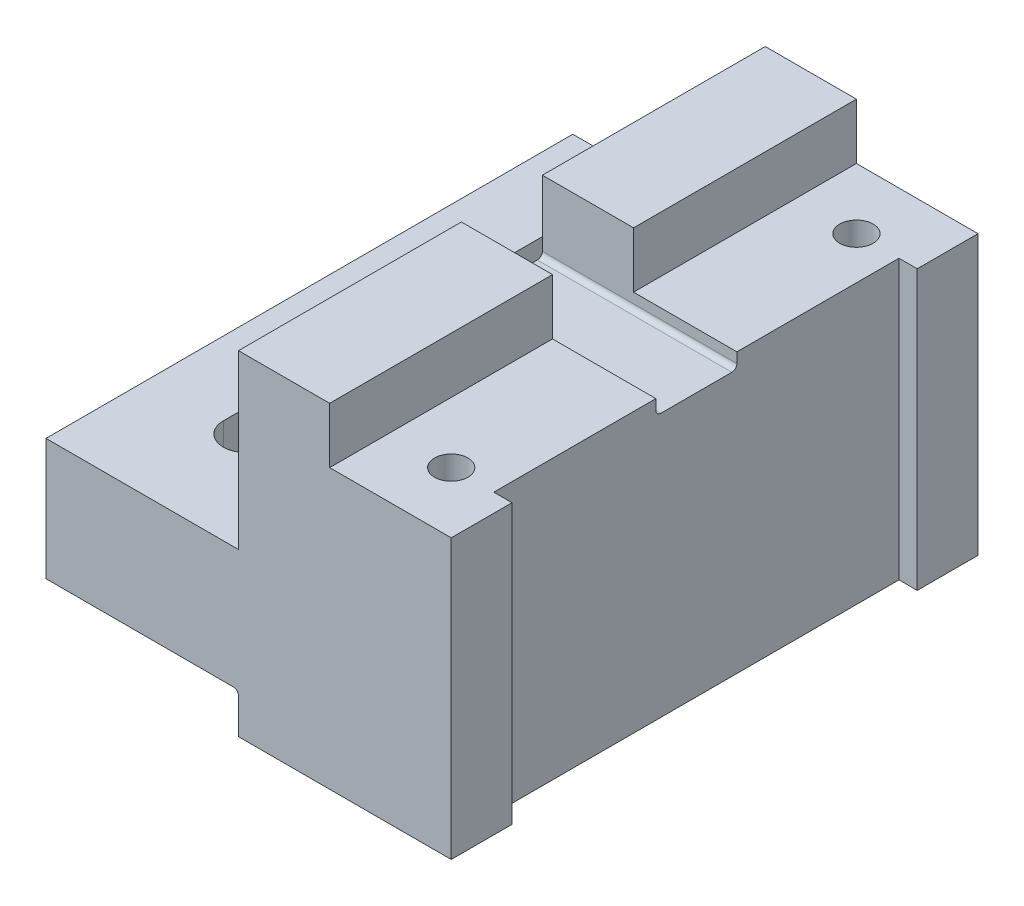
ISO-10303-21;
HEADER;
FILE_DESCRIPTION(('STEP AP214'),'2;1');
FILE_NAME('part.step','',(''),(''),'','','');
FILE_SCHEMA(('AUTOMOTIVE_DESIGN { 1 0 10303 214 1 1 1 1 }'));
ENDSEC;
DATA;
#1=APPLICATION_CONTEXT('core data for automotive mechanical design processes');
#2=APPLICATION_PROTOCOL_DEFINITION('international standard','automotive_design',2000,#1);
#3=PRODUCT_CONTEXT('',#1,'mechanical');
#4=PRODUCT('Part','Part','',(#3));
#5=PRODUCT_RELATED_PRODUCT_CATEGORY('part','',(#4));
#6=PRODUCT_DEFINITION_FORMATION('','',#4);
#7=PRODUCT_DEFINITION_CONTEXT('part definition',#1,'design');
#8=PRODUCT_DEFINITION('design','',#6,#7);
#9=PRODUCT_DEFINITION_SHAPE('','',#8);
#10=(LENGTH_UNIT() NAMED_UNIT(*) SI_UNIT(.MILLI.,.METRE.));
#11=(NAMED_UNIT(*) PLANE_ANGLE_UNIT() SI_UNIT($,.RADIAN.));
#12=(NAMED_UNIT(*) SI_UNIT($,.STERADIAN.) SOLID_ANGLE_UNIT());
#13=UNCERTAINTY_MEASURE_WITH_UNIT(LENGTH_MEASURE(1.E-05),#10,'distance_accuracy_value','');
#14=(GEOMETRIC_REPRESENTATION_CONTEXT(3) GLOBAL_UNCERTAINTY_ASSIGNED_CONTEXT((#13)) GLOBAL_UNIT_ASSIGNED_CONTEXT((#10,
#11,#12)) REPRESENTATION_CONTEXT('',''));
#15=CARTESIAN_POINT('',(0.,0.,0.));
#16=DIRECTION('',(0.,0.,1.));
#17=DIRECTION('',(1.,0.,0.));
#18=AXIS2_PLACEMENT_3D('',#15,#16,#17);
#19=CARTESIAN_POINT('',(148.,206.010687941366,52.));
#20=DIRECTION('',(0.,1.,0.));
#21=DIRECTION('',(0.,0.,1.));
#22=AXIS2_PLACEMENT_3D('',#19,#20,#21);
#23=PLANE('',#22);
#24=DIRECTION('',(1.,0.,0.));
#25=VECTOR('',#24,1.);
#26=CARTESIAN_POINT('',(148.,206.010687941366,0.));
#27=LINE('',#26,#25);
#28=CARTESIAN_POINT('',(148.,206.010687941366,0.));
#29=VERTEX_POINT('',#28);
#30=CARTESIAN_POINT('',(166.5,206.010687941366,0.));
#31=VERTEX_POINT('',#30);
#32=EDGE_CURVE('E482',#29,#31,#27,.T.);
#33=ORIENTED_EDGE('',*,*,#32,.T.);
#34=DIRECTION('',(0.,0.,-1.));
#35=VECTOR('',#34,1.);
#36=CARTESIAN_POINT('',(166.5,206.010687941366,52.));
#37=LINE('',#36,#35);
#38=CARTESIAN_POINT('',(166.5,206.010687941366,52.));
#39=VERTEX_POINT('',#38);
#40=EDGE_CURVE('E31',#31,#39,#37,.F.);
#41=ORIENTED_EDGE('',*,*,#40,.T.);
#42=DIRECTION('',(1.,0.,0.));
#43=VECTOR('',#42,1.);
#44=CARTESIAN_POINT('',(148.,206.010687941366,52.));
#45=LINE('',#44,#43);
#46=CARTESIAN_POINT('',(148.,206.010687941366,52.));
#47=VERTEX_POINT('',#46);
#48=EDGE_CURVE('E463',#47,#39,#45,.T.);
#49=ORIENTED_EDGE('',*,*,#48,.F.);
#50=DIRECTION('',(0.,0.,-1.));
#51=VECTOR('',#50,1.);
#52=CARTESIAN_POINT('',(148.,206.010687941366,52.));
#53=LINE('',#52,#51);
#54=EDGE_CURVE('E514',#47,#29,#53,.T.);
#55=ORIENTED_EDGE('',*,*,#54,.T.);
#56=EDGE_LOOP('',(#33,#41,#49,#55));
#57=FACE_BOUND('',#56,.T.);
#58=DIRECTION('',(0.,0.,1.));
#59=VECTOR('',#58,1.);
#60=CARTESIAN_POINT('',(153.5,206.010687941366,38.25));
#61=LINE('',#60,#59);
#62=CARTESIAN_POINT('',(153.5,206.010687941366,38.25));
#63=VERTEX_POINT('',#62);
#64=CARTESIAN_POINT('',(153.5,206.010687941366,41.75));
#65=VERTEX_POINT('',#64);
#66=EDGE_CURVE('E338',#63,#65,#61,.T.);
#67=ORIENTED_EDGE('',*,*,#66,.T.);
#68=CARTESIAN_POINT('',(157.5,206.010687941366,41.75));
#69=DIRECTION('',(0.,-1.,0.));
#70=DIRECTION('',(0.,0.,-1.));
#71=AXIS2_PLACEMENT_3D('',#68,#69,#70);
#72=CIRCLE('',#71,4.);
#73=CARTESIAN_POINT('',(161.5,206.010687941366,41.75));
#74=VERTEX_POINT('',#73);
#75=EDGE_CURVE('E366',#74,#65,#72,.T.);
#76=ORIENTED_EDGE('',*,*,#75,.F.);
#77=DIRECTION('',(0.,0.,1.));
#78=VECTOR('',#77,1.);
#79=CARTESIAN_POINT('',(161.5,206.010687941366,38.25));
#80=LINE('',#79,#78);
#81=CARTESIAN_POINT('',(161.5,206.010687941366,38.25));
#82=VERTEX_POINT('',#81);
#83=EDGE_CURVE('E327',#82,#74,#80,.T.);
#84=ORIENTED_EDGE('',*,*,#83,.F.);
#85=CARTESIAN_POINT('',(157.5,206.010687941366,38.25));
#86=DIRECTION('',(0.,-1.,0.));
#87=DIRECTION('',(0.,0.,-1.));
#88=AXIS2_PLACEMENT_3D('',#85,#86,#87);
#89=CIRCLE('',#88,4.);
#90=EDGE_CURVE('E350',#63,#82,#89,.T.);
#91=ORIENTED_EDGE('',*,*,#90,.F.);
#92=EDGE_LOOP('',(#67,#76,#84,#91));
#93=FACE_BOUND('',#92,.T.);
#94=CARTESIAN_POINT('',(157.5,206.010687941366,13.75));
#95=DIRECTION('',(0.,-1.,0.));
#96=DIRECTION('',(0.,0.,-1.));
#97=AXIS2_PLACEMENT_3D('',#94,#95,#96);
#98=CIRCLE('',#97,4.);
#99=CARTESIAN_POINT('',(161.5,206.010687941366,13.75));
#100=VERTEX_POINT('',#99);
#101=CARTESIAN_POINT('',(153.5,206.010687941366,13.75));
#102=VERTEX_POINT('',#101);
#103=EDGE_CURVE('E317',#100,#102,#98,.T.);
#104=ORIENTED_EDGE('',*,*,#103,.F.);
#105=DIRECTION('',(0.,0.,1.));
#106=VECTOR('',#105,1.);
#107=CARTESIAN_POINT('',(161.5,206.010687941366,10.25));
#108=LINE('',#107,#106);
#109=CARTESIAN_POINT('',(161.5,206.010687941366,10.25));
#110=VERTEX_POINT('',#109);
#111=EDGE_CURVE('E293',#110,#100,#108,.T.);
#112=ORIENTED_EDGE('',*,*,#111,.F.);
#113=CARTESIAN_POINT('',(157.5,206.010687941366,10.25));
#114=DIRECTION('',(0.,-1.,0.));
#115=DIRECTION('',(0.,0.,-1.));
#116=AXIS2_PLACEMENT_3D('',#113,#114,#115);
#117=CIRCLE('',#116,4.);
#118=CARTESIAN_POINT('',(153.5,206.010687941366,10.25));
#119=VERTEX_POINT('',#118);
#120=EDGE_CURVE('E283',#119,#110,#117,.T.);
#121=ORIENTED_EDGE('',*,*,#120,.F.);
#122=DIRECTION('',(0.,0.,1.));
#123=VECTOR('',#122,1.);
#124=CARTESIAN_POINT('',(153.5,206.010687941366,10.25));
#125=LINE('',#124,#123);
#126=EDGE_CURVE('E303',#119,#102,#125,.T.);
#127=ORIENTED_EDGE('',*,*,#126,.T.);
#128=EDGE_LOOP('',(#104,#112,#121,#127));
#129=FACE_BOUND('',#128,.T.);
#130=ADVANCED_FACE('F16',(#57,#93,#129),#23,.F.);
#131=CARTESIAN_POINT('',(167.,235.010687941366,52.));
#132=DIRECTION('',(0.,-1.,0.));
#133=DIRECTION('',(0.,0.,-1.));
#134=AXIS2_PLACEMENT_3D('',#131,#132,#133);
#135=PLANE('',#134);
#136=DIRECTION('',(0.,0.,-1.));
#137=VECTOR('',#136,1.);
#138=CARTESIAN_POINT('',(167.,235.010687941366,52.));
#139=LINE('',#138,#137);
#140=CARTESIAN_POINT('',(167.,235.010687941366,22.));
#141=VERTEX_POINT('',#140);
#142=CARTESIAN_POINT('',(167.,235.010687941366,0.));
#143=VERTEX_POINT('',#142);
#144=EDGE_CURVE('E503',#141,#143,#139,.T.);
#145=ORIENTED_EDGE('',*,*,#144,.F.);
#146=DIRECTION('',(-1.,0.,0.));
#147=VECTOR('',#146,1.);
#148=CARTESIAN_POINT('',(167.,235.010687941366,22.));
#149=LINE('',#148,#147);
#150=CARTESIAN_POINT('',(176.,235.010687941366,22.));
#151=VERTEX_POINT('',#150);
#152=EDGE_CURVE('E382',#151,#141,#149,.T.);
#153=ORIENTED_EDGE('',*,*,#152,.F.);
#154=DIRECTION('',(0.,0.,1.));
#155=VECTOR('',#154,1.);
#156=CARTESIAN_POINT('',(176.,235.010687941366,0.));
#157=LINE('',#156,#155);
#158=CARTESIAN_POINT('',(176.,235.010687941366,0.));
#159=VERTEX_POINT('',#158);
#160=EDGE_CURVE('E433',#159,#151,#157,.T.);
#161=ORIENTED_EDGE('',*,*,#160,.F.);
#162=DIRECTION('',(-1.,0.,0.));
#163=VECTOR('',#162,1.);
#164=CARTESIAN_POINT('',(167.,235.010687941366,0.));
#165=LINE('',#164,#163);
#166=EDGE_CURVE('E492',#159,#143,#165,.T.);
#167=ORIENTED_EDGE('',*,*,#166,.T.);
#168=EDGE_LOOP('',(#145,#153,#161,#167));
#169=FACE_BOUND('',#168,.T.);
#170=ADVANCED_FACE('F606',(#169),#135,.F.);
#171=CARTESIAN_POINT('',(188.,229.510687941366,0.));
#172=DIRECTION('',(0.,-1.,0.));
#173=DIRECTION('',(0.,0.,-1.));
#174=AXIS2_PLACEMENT_3D('',#171,#172,#173);
#175=PLANE('',#174);
#176=CARTESIAN_POINT('',(182.,229.510687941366,6.));
#177=DIRECTION('',(0.,1.,0.));
#178=DIRECTION('',(0.,0.,1.));
#179=AXIS2_PLACEMENT_3D('',#176,#177,#178);
#180=CIRCLE('',#179,1.65);
#181=CARTESIAN_POINT('',(182.,229.510687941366,7.65));
#182=VERTEX_POINT('',#181);
#183=EDGE_CURVE('E406',#182,#182,#180,.T.);
#184=ORIENTED_EDGE('',*,*,#183,.F.);
#185=EDGE_LOOP('',(#184));
#186=FACE_BOUND('',#185,.T.);
#187=DIRECTION('',(0.,0.,1.));
#188=VECTOR('',#187,1.);
#189=CARTESIAN_POINT('',(176.,229.510687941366,0.));
#190=LINE('',#189,#188);
#191=CARTESIAN_POINT('',(176.,229.510687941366,0.));
#192=VERTEX_POINT('',#191);
#193=CARTESIAN_POINT('',(176.,229.510687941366,22.));
#194=VERTEX_POINT('',#193);
#195=EDGE_CURVE('E429',#192,#194,#190,.T.);
#196=ORIENTED_EDGE('',*,*,#195,.T.);
#197=DIRECTION('',(1.,0.,0.));
#198=VECTOR('',#197,1.);
#199=CARTESIAN_POINT('',(188.,229.510687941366,22.));
#200=LINE('',#199,#198);
#201=CARTESIAN_POINT('',(186.199999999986,229.510687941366,22.));
#202=VERTEX_POINT('',#201);
#203=EDGE_CURVE('E394',#194,#202,#200,.T.);
#204=ORIENTED_EDGE('',*,*,#203,.T.);
#205=DIRECTION('',(0.,0.,1.));
#206=VECTOR('',#205,1.);
#207=CARTESIAN_POINT('',(186.199999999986,229.510687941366,5.99999999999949));
#208=LINE('',#207,#206);
#209=CARTESIAN_POINT('',(186.199999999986,229.510687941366,5.99999999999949));
#210=VERTEX_POINT('',#209);
#211=EDGE_CURVE('E518',#210,#202,#208,.T.);
#212=ORIENTED_EDGE('',*,*,#211,.F.);
#213=DIRECTION('',(-1.,0.,0.));
#214=VECTOR('',#213,1.);
#215=CARTESIAN_POINT('',(186.199999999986,229.510687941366,5.99999999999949));
#216=LINE('',#215,#214);
#217=CARTESIAN_POINT('',(188.,229.510687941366,5.99999999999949));
#218=VERTEX_POINT('',#217);
#219=EDGE_CURVE('E427',#218,#210,#216,.T.);
#220=ORIENTED_EDGE('',*,*,#219,.F.);
#221=DIRECTION('',(0.,0.,1.));
#222=VECTOR('',#221,1.);
#223=CARTESIAN_POINT('',(188.,229.510687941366,0.));
#224=LINE('',#223,#222);
#225=CARTESIAN_POINT('',(188.,229.510687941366,0.));
#226=VERTEX_POINT('',#225);
#227=EDGE_CURVE('E424',#226,#218,#224,.T.);
#228=ORIENTED_EDGE('',*,*,#227,.F.);
#229=DIRECTION('',(1.,0.,0.));
#230=VECTOR('',#229,1.);
#231=CARTESIAN_POINT('',(188.,229.510687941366,0.));
#232=LINE('',#231,#230);
#233=EDGE_CURVE('E416',#192,#226,#232,.T.);
#234=ORIENTED_EDGE('',*,*,#233,.F.);
#235=EDGE_LOOP('',(#196,#204,#212,#220,#228,#234));
#236=FACE_BOUND('',#235,.T.);
#237=ADVANCED_FACE('F612',(#186,#236),#175,.F.);
#238=CARTESIAN_POINT('',(176.,235.010687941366,0.));
#239=DIRECTION('',(-1.,0.,0.));
#240=DIRECTION('',(0.,0.,1.));
#241=AXIS2_PLACEMENT_3D('',#238,#239,#240);
#242=PLANE('',#241);
#243=ORIENTED_EDGE('',*,*,#160,.T.);
#244=DIRECTION('',(0.,-1.,0.));
#245=VECTOR('',#244,1.);
#246=CARTESIAN_POINT('',(176.,235.010687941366,22.));
#247=LINE('',#246,#245);
#248=EDGE_CURVE('E524',#151,#194,#247,.T.);
#249=ORIENTED_EDGE('',*,*,#248,.T.);
#250=ORIENTED_EDGE('',*,*,#195,.F.);
#251=DIRECTION('',(0.,-1.,0.));
#252=VECTOR('',#251,1.);
#253=CARTESIAN_POINT('',(176.,235.010687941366,0.));
#254=LINE('',#253,#252);
#255=EDGE_CURVE('E413',#159,#192,#254,.T.);
#256=ORIENTED_EDGE('',*,*,#255,.F.);
#257=EDGE_LOOP('',(#243,#249,#250,#256));
#258=FACE_BOUND('',#257,.T.);
#259=ADVANCED_FACE('F694',(#258),#242,.F.);
#260=CARTESIAN_POINT('',(188.,202.010687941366,52.));
#261=DIRECTION('',(-1.,0.,0.));
#262=DIRECTION('',(0.,0.,1.));
#263=AXIS2_PLACEMENT_3D('',#260,#261,#262);
#264=PLANE('',#263);
#265=DIRECTION('',(0.,1.,0.));
#266=VECTOR('',#265,1.);
#267=CARTESIAN_POINT('',(188.,202.010687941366,46.));
#268=LINE('',#267,#266);
#269=CARTESIAN_POINT('',(188.,202.010687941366,46.));
#270=VERTEX_POINT('',#269);
#271=CARTESIAN_POINT('',(188.,229.510687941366,46.));
#272=VERTEX_POINT('',#271);
#273=EDGE_CURVE('E456',#270,#272,#268,.T.);
#274=ORIENTED_EDGE('',*,*,#273,.T.);
#275=CARTESIAN_POINT('',(188.,229.510687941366,52.));
#276=VERTEX_POINT('',#275);
#277=EDGE_CURVE('E428',#272,#276,#224,.T.);
#278=ORIENTED_EDGE('',*,*,#277,.T.);
#279=DIRECTION('',(0.,1.,0.));
#280=VECTOR('',#279,1.);
#281=CARTESIAN_POINT('',(188.,202.010687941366,52.));
#282=LINE('',#281,#280);
#283=CARTESIAN_POINT('',(188.,202.010687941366,52.));
#284=VERTEX_POINT('',#283);
#285=EDGE_CURVE('E470',#284,#276,#282,.T.);
#286=ORIENTED_EDGE('',*,*,#285,.F.);
#287=DIRECTION('',(0.,0.,-1.));
#288=VECTOR('',#287,1.);
#289=CARTESIAN_POINT('',(188.,202.010687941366,52.));
#290=LINE('',#289,#288);
#291=EDGE_CURVE('E508',#284,#270,#290,.T.);
#292=ORIENTED_EDGE('',*,*,#291,.T.);
#293=EDGE_LOOP('',(#274,#278,#286,#292));
#294=FACE_BOUND('',#293,.T.);
#295=ADVANCED_FACE('F623',(#294),#264,.F.);
#296=CARTESIAN_POINT('',(148.,206.010687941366,52.));
#297=DIRECTION('',(1.,0.,0.));
#298=DIRECTION('',(0.,0.,-1.));
#299=AXIS2_PLACEMENT_3D('',#296,#297,#298);
#300=PLANE('',#299);
#301=DIRECTION('',(0.,-1.,0.));
#302=VECTOR('',#301,1.);
#303=CARTESIAN_POINT('',(148.,206.010687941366,0.));
#304=LINE('',#303,#302);
#305=CARTESIAN_POINT('',(148.,218.010687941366,0.));
#306=VERTEX_POINT('',#305);
#307=EDGE_CURVE('E459',#306,#29,#304,.T.);
#308=ORIENTED_EDGE('',*,*,#307,.T.);
#309=ORIENTED_EDGE('',*,*,#54,.F.);
#310=DIRECTION('',(0.,-1.,0.));
#311=VECTOR('',#310,1.);
#312=CARTESIAN_POINT('',(148.,206.010687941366,52.));
#313=LINE('',#312,#311);
#314=CARTESIAN_POINT('',(148.,218.010687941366,52.));
#315=VERTEX_POINT('',#314);
#316=EDGE_CURVE('E460',#315,#47,#313,.T.);
#317=ORIENTED_EDGE('',*,*,#316,.F.);
#318=DIRECTION('',(0.,0.,-1.));
#319=VECTOR('',#318,1.);
#320=CARTESIAN_POINT('',(148.,218.010687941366,52.));
#321=LINE('',#320,#319);
#322=EDGE_CURVE('E479',#315,#306,#321,.T.);
#323=ORIENTED_EDGE('',*,*,#322,.T.);
#324=EDGE_LOOP('',(#308,#309,#317,#323));
#325=FACE_BOUND('',#324,.T.);
#326=ADVANCED_FACE('F620',(#325),#300,.F.);
#327=CARTESIAN_POINT('',(167.,206.010687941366,52.));
#328=DIRECTION('',(1.,0.,0.));
#329=DIRECTION('',(0.,0.,-1.));
#330=AXIS2_PLACEMENT_3D('',#327,#328,#329);
#331=PLANE('',#330);
#332=DIRECTION('',(0.,-1.,0.));
#333=VECTOR('',#332,1.);
#334=CARTESIAN_POINT('',(167.,206.010687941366,52.));
#335=LINE('',#334,#333);
#336=CARTESIAN_POINT('',(167.,205.510687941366,52.));
#337=VERTEX_POINT('',#336);
#338=CARTESIAN_POINT('',(167.,202.010687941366,52.));
#339=VERTEX_POINT('',#338);
#340=EDGE_CURVE('E466',#337,#339,#335,.T.);
#341=ORIENTED_EDGE('',*,*,#340,.F.);
#342=DIRECTION('',(0.,0.,-1.));
#343=VECTOR('',#342,1.);
#344=CARTESIAN_POINT('',(167.,205.510687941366,0.));
#345=LINE('',#344,#343);
#346=CARTESIAN_POINT('',(167.,205.510687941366,0.));
#347=VERTEX_POINT('',#346);
#348=EDGE_CURVE('E572',#337,#347,#345,.T.);
#349=ORIENTED_EDGE('',*,*,#348,.T.);
#350=DIRECTION('',(0.,-1.,0.));
#351=VECTOR('',#350,1.);
#352=CARTESIAN_POINT('',(167.,206.010687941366,0.));
#353=LINE('',#352,#351);
#354=CARTESIAN_POINT('',(167.,202.010687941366,0.));
#355=VERTEX_POINT('',#354);
#356=EDGE_CURVE('E484',#347,#355,#353,.T.);
#357=ORIENTED_EDGE('',*,*,#356,.T.);
#358=DIRECTION('',(0.,0.,-1.));
#359=VECTOR('',#358,1.);
#360=CARTESIAN_POINT('',(167.,202.010687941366,52.));
#361=LINE('',#360,#359);
#362=EDGE_CURVE('E511',#339,#355,#361,.T.);
#363=ORIENTED_EDGE('',*,*,#362,.F.);
#364=EDGE_LOOP('',(#341,#349,#357,#363));
#365=FACE_BOUND('',#364,.T.);
#366=ADVANCED_FACE('F578',(#365),#331,.F.);
#367=CARTESIAN_POINT('',(188.,202.010687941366,52.));
#368=DIRECTION('',(0.,1.,0.));
#369=DIRECTION('',(0.,0.,1.));
#370=AXIS2_PLACEMENT_3D('',#367,#368,#369);
#371=PLANE('',#370);
#372=DIRECTION('',(0.,0.,-1.));
#373=VECTOR('',#372,1.);
#374=CARTESIAN_POINT('',(186.199999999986,202.010687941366,5.99999999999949));
#375=LINE('',#374,#373);
#376=CARTESIAN_POINT('',(186.199999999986,202.010687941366,46.));
#377=VERTEX_POINT('',#376);
#378=CARTESIAN_POINT('',(186.199999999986,202.010687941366,5.99999999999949));
#379=VERTEX_POINT('',#378);
#380=EDGE_CURVE('E441',#377,#379,#375,.T.);
#381=ORIENTED_EDGE('',*,*,#380,.F.);
#382=DIRECTION('',(-1.,0.,0.));
#383=VECTOR('',#382,1.);
#384=CARTESIAN_POINT('',(186.199999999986,202.010687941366,46.));
#385=LINE('',#384,#383);
#386=EDGE_CURVE('E447',#270,#377,#385,.T.);
#387=ORIENTED_EDGE('',*,*,#386,.F.);
#388=ORIENTED_EDGE('',*,*,#291,.F.);
#389=DIRECTION('',(1.,0.,0.));
#390=VECTOR('',#389,1.);
#391=CARTESIAN_POINT('',(188.,202.010687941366,52.));
#392=LINE('',#391,#390);
#393=EDGE_CURVE('E468',#339,#284,#392,.T.);
#394=ORIENTED_EDGE('',*,*,#393,.F.);
#395=ORIENTED_EDGE('',*,*,#362,.T.);
#396=DIRECTION('',(1.,0.,0.));
#397=VECTOR('',#396,1.);
#398=CARTESIAN_POINT('',(188.,202.010687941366,0.));
#399=LINE('',#398,#397);
#400=CARTESIAN_POINT('',(188.,202.010687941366,0.));
#401=VERTEX_POINT('',#400);
#402=EDGE_CURVE('E486',#355,#401,#399,.T.);
#403=ORIENTED_EDGE('',*,*,#402,.T.);
#404=CARTESIAN_POINT('',(188.,202.010687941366,5.99999999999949));
#405=VERTEX_POINT('',#404);
#406=EDGE_CURVE('E507',#405,#401,#290,.T.);
#407=ORIENTED_EDGE('',*,*,#406,.F.);
#408=DIRECTION('',(1.,0.,0.));
#409=VECTOR('',#408,1.);
#410=CARTESIAN_POINT('',(186.199999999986,202.010687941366,5.99999999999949));
#411=LINE('',#410,#409);
#412=EDGE_CURVE('E444',#379,#405,#411,.T.);
#413=ORIENTED_EDGE('',*,*,#412,.F.);
#414=EDGE_LOOP('',(#381,#387,#388,#394,#395,#403,#407,#413));
#415=FACE_BOUND('',#414,.T.);
#416=ADVANCED_FACE('F588',(#415),#371,.F.);
#417=DIRECTION('',(0.,1.,0.));
#418=VECTOR('',#417,1.);
#419=CARTESIAN_POINT('',(188.,202.010687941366,0.));
#420=LINE('',#419,#418);
#421=EDGE_CURVE('E489',#401,#226,#420,.T.);
#422=ORIENTED_EDGE('',*,*,#421,.T.);
#423=ORIENTED_EDGE('',*,*,#227,.T.);
#424=DIRECTION('',(0.,-1.,0.));
#425=VECTOR('',#424,1.);
#426=CARTESIAN_POINT('',(188.,202.010687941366,5.99999999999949));
#427=LINE('',#426,#425);
#428=EDGE_CURVE('E453',#218,#405,#427,.T.);
#429=ORIENTED_EDGE('',*,*,#428,.T.);
#430=ORIENTED_EDGE('',*,*,#406,.T.);
#431=EDGE_LOOP('',(#422,#423,#429,#430));
#432=FACE_BOUND('',#431,.T.);
#433=ADVANCED_FACE('F696',(#432),#264,.F.);
#434=CARTESIAN_POINT('',(176.,235.010687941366,30.));
#435=VERTEX_POINT('',#434);
#436=CARTESIAN_POINT('',(176.,235.010687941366,52.));
#437=VERTEX_POINT('',#436);
#438=EDGE_CURVE('E420',#435,#437,#157,.T.);
#439=ORIENTED_EDGE('',*,*,#438,.F.);
#440=DIRECTION('',(1.,0.,0.));
#441=VECTOR('',#440,1.);
#442=CARTESIAN_POINT('',(167.,235.010687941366,30.));
#443=LINE('',#442,#441);
#444=CARTESIAN_POINT('',(167.,235.010687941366,30.));
#445=VERTEX_POINT('',#444);
#446=EDGE_CURVE('E377',#445,#435,#443,.T.);
#447=ORIENTED_EDGE('',*,*,#446,.F.);
#448=CARTESIAN_POINT('',(167.,235.010687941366,52.));
#449=VERTEX_POINT('',#448);
#450=EDGE_CURVE('E504',#449,#445,#139,.T.);
#451=ORIENTED_EDGE('',*,*,#450,.F.);
#452=DIRECTION('',(-1.,0.,0.));
#453=VECTOR('',#452,1.);
#454=CARTESIAN_POINT('',(167.,235.010687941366,52.));
#455=LINE('',#454,#453);
#456=EDGE_CURVE('E473',#437,#449,#455,.T.);
#457=ORIENTED_EDGE('',*,*,#456,.F.);
#458=EDGE_LOOP('',(#439,#447,#451,#457));
#459=FACE_BOUND('',#458,.T.);
#460=ADVANCED_FACE('F615',(#459),#135,.F.);
#461=CARTESIAN_POINT('',(167.,235.010687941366,52.));
#462=DIRECTION('',(1.,0.,0.));
#463=DIRECTION('',(0.,0.,-1.));
#464=AXIS2_PLACEMENT_3D('',#461,#462,#463);
#465=PLANE('',#464);
#466=DIRECTION('',(0.,0.,1.));
#467=VECTOR('',#466,1.);
#468=CARTESIAN_POINT('',(167.,228.010687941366,30.));
#469=LINE('',#468,#467);
#470=CARTESIAN_POINT('',(167.,228.010687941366,22.5));
#471=VERTEX_POINT('',#470);
#472=CARTESIAN_POINT('',(167.,228.010687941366,29.5));
#473=VERTEX_POINT('',#472);
#474=EDGE_CURVE('E378',#471,#473,#469,.T.);
#475=ORIENTED_EDGE('',*,*,#474,.F.);
#476=CARTESIAN_POINT('',(167.,228.510687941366,22.5));
#477=DIRECTION('',(1.,0.,0.));
#478=DIRECTION('',(0.,0.,-1.));
#479=AXIS2_PLACEMENT_3D('',#476,#477,#478);
#480=CIRCLE('',#479,0.5);
#481=CARTESIAN_POINT('',(167.,228.510687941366,22.));
#482=VERTEX_POINT('',#481);
#483=EDGE_CURVE('E540',#471,#482,#480,.T.);
#484=ORIENTED_EDGE('',*,*,#483,.T.);
#485=DIRECTION('',(0.,1.,0.));
#486=VECTOR('',#485,1.);
#487=CARTESIAN_POINT('',(167.,228.010687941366,22.));
#488=LINE('',#487,#486);
#489=EDGE_CURVE('E386',#482,#141,#488,.T.);
#490=ORIENTED_EDGE('',*,*,#489,.T.);
#491=ORIENTED_EDGE('',*,*,#144,.T.);
#492=DIRECTION('',(0.,-1.,0.));
#493=VECTOR('',#492,1.);
#494=CARTESIAN_POINT('',(167.,235.010687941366,0.));
#495=LINE('',#494,#493);
#496=CARTESIAN_POINT('',(167.,218.010687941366,0.));
#497=VERTEX_POINT('',#496);
#498=EDGE_CURVE('E495',#143,#497,#495,.T.);
#499=ORIENTED_EDGE('',*,*,#498,.T.);
#500=DIRECTION('',(0.,0.,-1.));
#501=VECTOR('',#500,1.);
#502=CARTESIAN_POINT('',(167.,218.010687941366,52.));
#503=LINE('',#502,#501);
#504=CARTESIAN_POINT('',(167.,218.010687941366,52.));
#505=VERTEX_POINT('',#504);
#506=EDGE_CURVE('E500',#505,#497,#503,.T.);
#507=ORIENTED_EDGE('',*,*,#506,.F.);
#508=DIRECTION('',(0.,-1.,0.));
#509=VECTOR('',#508,1.);
#510=CARTESIAN_POINT('',(167.,235.010687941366,52.));
#511=LINE('',#510,#509);
#512=EDGE_CURVE('E475',#449,#505,#511,.T.);
#513=ORIENTED_EDGE('',*,*,#512,.F.);
#514=ORIENTED_EDGE('',*,*,#450,.T.);
#515=DIRECTION('',(0.,1.,0.));
#516=VECTOR('',#515,1.);
#517=CARTESIAN_POINT('',(167.,228.010687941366,30.));
#518=LINE('',#517,#516);
#519=CARTESIAN_POINT('',(167.,228.510687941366,30.));
#520=VERTEX_POINT('',#519);
#521=EDGE_CURVE('E381',#520,#445,#518,.T.);
#522=ORIENTED_EDGE('',*,*,#521,.F.);
#523=CARTESIAN_POINT('',(167.,228.510687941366,29.5));
#524=DIRECTION('',(1.,0.,0.));
#525=DIRECTION('',(0.,0.,-1.));
#526=AXIS2_PLACEMENT_3D('',#523,#524,#525);
#527=CIRCLE('',#526,0.5);
#528=EDGE_CURVE('E546',#520,#473,#527,.T.);
#529=ORIENTED_EDGE('',*,*,#528,.T.);
#530=EDGE_LOOP('',(#475,#484,#490,#491,#499,#507,#513,#514,#522,#529));
#531=FACE_BOUND('',#530,.T.);
#532=ADVANCED_FACE('F646',(#531),#465,.F.);
#533=CARTESIAN_POINT('',(148.,218.010687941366,52.));
#534=DIRECTION('',(0.,-1.,0.));
#535=DIRECTION('',(0.,0.,-1.));
#536=AXIS2_PLACEMENT_3D('',#533,#534,#535);
#537=PLANE('',#536);
#538=CARTESIAN_POINT('',(157.5,218.010687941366,10.25));
#539=DIRECTION('',(0.,-1.,0.));
#540=DIRECTION('',(0.,0.,-1.));
#541=AXIS2_PLACEMENT_3D('',#538,#539,#540);
#542=CIRCLE('',#541,2.25);
#543=CARTESIAN_POINT('',(155.25,218.010687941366,10.25));
#544=VERTEX_POINT('',#543);
#545=CARTESIAN_POINT('',(159.75,218.010687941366,10.25));
#546=VERTEX_POINT('',#545);
#547=EDGE_CURVE('E563',#544,#546,#542,.T.);
#548=ORIENTED_EDGE('',*,*,#547,.T.);
#549=DIRECTION('',(0.,0.,1.));
#550=VECTOR('',#549,1.);
#551=CARTESIAN_POINT('',(159.75,218.010687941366,52.));
#552=LINE('',#551,#550);
#553=CARTESIAN_POINT('',(159.75,218.010687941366,13.75));
#554=VERTEX_POINT('',#553);
#555=EDGE_CURVE('E569',#546,#554,#552,.T.);
#556=ORIENTED_EDGE('',*,*,#555,.T.);
#557=CARTESIAN_POINT('',(157.5,218.010687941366,13.75));
#558=DIRECTION('',(0.,-1.,0.));
#559=DIRECTION('',(0.,0.,-1.));
#560=AXIS2_PLACEMENT_3D('',#557,#558,#559);
#561=CIRCLE('',#560,2.25);
#562=CARTESIAN_POINT('',(155.25,218.010687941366,13.75));
#563=VERTEX_POINT('',#562);
#564=EDGE_CURVE('E566',#554,#563,#561,.T.);
#565=ORIENTED_EDGE('',*,*,#564,.T.);
#566=DIRECTION('',(0.,0.,-1.));
#567=VECTOR('',#566,1.);
#568=CARTESIAN_POINT('',(155.25,218.010687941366,52.));
#569=LINE('',#568,#567);
#570=EDGE_CURVE('E560',#563,#544,#569,.T.);
#571=ORIENTED_EDGE('',*,*,#570,.T.);
#572=EDGE_LOOP('',(#548,#556,#565,#571));
#573=FACE_BOUND('',#572,.T.);
#574=CARTESIAN_POINT('',(157.5,218.010687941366,41.75));
#575=DIRECTION('',(0.,-1.,0.));
#576=DIRECTION('',(0.,0.,-1.));
#577=AXIS2_PLACEMENT_3D('',#574,#575,#576);
#578=CIRCLE('',#577,2.25);
#579=CARTESIAN_POINT('',(159.75,218.010687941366,41.75));
#580=VERTEX_POINT('',#579);
#581=CARTESIAN_POINT('',(155.25,218.010687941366,41.75));
#582=VERTEX_POINT('',#581);
#583=EDGE_CURVE('E554',#580,#582,#578,.T.);
#584=ORIENTED_EDGE('',*,*,#583,.T.);
#585=DIRECTION('',(0.,0.,-1.));
#586=VECTOR('',#585,1.);
#587=CARTESIAN_POINT('',(155.25,218.010687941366,52.));
#588=LINE('',#587,#586);
#589=CARTESIAN_POINT('',(155.25,218.010687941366,38.25));
#590=VERTEX_POINT('',#589);
#591=EDGE_CURVE('E557',#582,#590,#588,.T.);
#592=ORIENTED_EDGE('',*,*,#591,.T.);
#593=CARTESIAN_POINT('',(157.5,218.010687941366,38.25));
#594=DIRECTION('',(0.,-1.,0.));
#595=DIRECTION('',(0.,0.,-1.));
#596=AXIS2_PLACEMENT_3D('',#593,#594,#595);
#597=CIRCLE('',#596,2.25);
#598=CARTESIAN_POINT('',(159.75,218.010687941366,38.25));
#599=VERTEX_POINT('',#598);
#600=EDGE_CURVE('E551',#590,#599,#597,.T.);
#601=ORIENTED_EDGE('',*,*,#600,.T.);
#602=DIRECTION('',(0.,0.,1.));
#603=VECTOR('',#602,1.);
#604=CARTESIAN_POINT('',(159.75,218.010687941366,52.));
#605=LINE('',#604,#603);
#606=EDGE_CURVE('E548',#599,#580,#605,.T.);
#607=ORIENTED_EDGE('',*,*,#606,.T.);
#608=EDGE_LOOP('',(#584,#592,#601,#607));
#609=FACE_BOUND('',#608,.T.);
#610=DIRECTION('',(-1.,0.,0.));
#611=VECTOR('',#610,1.);
#612=CARTESIAN_POINT('',(148.,218.010687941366,0.));
#613=LINE('',#612,#611);
#614=EDGE_CURVE('E464',#497,#306,#613,.T.);
#615=ORIENTED_EDGE('',*,*,#614,.T.);
#616=ORIENTED_EDGE('',*,*,#322,.F.);
#617=DIRECTION('',(-1.,0.,0.));
#618=VECTOR('',#617,1.);
#619=CARTESIAN_POINT('',(148.,218.010687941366,52.));
#620=LINE('',#619,#618);
#621=EDGE_CURVE('E477',#505,#315,#620,.T.);
#622=ORIENTED_EDGE('',*,*,#621,.F.);
#623=ORIENTED_EDGE('',*,*,#506,.T.);
#624=EDGE_LOOP('',(#615,#616,#622,#623));
#625=FACE_BOUND('',#624,.T.);
#626=ADVANCED_FACE('F666',(#573,#609,#625),#537,.F.);
#627=CARTESIAN_POINT('',(0.,0.,52.));
#628=DIRECTION('',(0.,0.,-1.));
#629=DIRECTION('',(-1.,0.,0.));
#630=AXIS2_PLACEMENT_3D('',#627,#628,#629);
#631=PLANE('',#630);
#632=ORIENTED_EDGE('',*,*,#285,.T.);
#633=DIRECTION('',(1.,0.,0.));
#634=VECTOR('',#633,1.);
#635=CARTESIAN_POINT('',(188.,229.510687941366,52.));
#636=LINE('',#635,#634);
#637=CARTESIAN_POINT('',(176.,229.510687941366,52.));
#638=VERTEX_POINT('',#637);
#639=EDGE_CURVE('E417',#638,#276,#636,.T.);
#640=ORIENTED_EDGE('',*,*,#639,.F.);
#641=DIRECTION('',(0.,-1.,0.));
#642=VECTOR('',#641,1.);
#643=CARTESIAN_POINT('',(176.,235.010687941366,52.));
#644=LINE('',#643,#642);
#645=EDGE_CURVE('E412',#437,#638,#644,.T.);
#646=ORIENTED_EDGE('',*,*,#645,.F.);
#647=ORIENTED_EDGE('',*,*,#456,.T.);
#648=ORIENTED_EDGE('',*,*,#512,.T.);
#649=ORIENTED_EDGE('',*,*,#621,.T.);
#650=ORIENTED_EDGE('',*,*,#316,.T.);
#651=ORIENTED_EDGE('',*,*,#48,.T.);
#652=CARTESIAN_POINT('',(166.5,205.510687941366,52.));
#653=DIRECTION('',(0.,0.,-1.));
#654=DIRECTION('',(-1.,0.,0.));
#655=AXIS2_PLACEMENT_3D('',#652,#653,#654);
#656=CIRCLE('',#655,0.5);
#657=EDGE_CURVE('E11',#39,#337,#656,.T.);
#658=ORIENTED_EDGE('',*,*,#657,.T.);
#659=ORIENTED_EDGE('',*,*,#340,.T.);
#660=ORIENTED_EDGE('',*,*,#393,.T.);
#661=EDGE_LOOP('',(#632,#640,#646,#647,#648,#649,#650,#651,#658,#659,#660));
#662=FACE_BOUND('',#661,.T.);
#663=ADVANCED_FACE('F595',(#662),#631,.F.);
#664=CARTESIAN_POINT('',(0.,0.,0.));
#665=DIRECTION('',(0.,0.,-1.));
#666=DIRECTION('',(-1.,0.,0.));
#667=AXIS2_PLACEMENT_3D('',#664,#665,#666);
#668=PLANE('',#667);
#669=ORIENTED_EDGE('',*,*,#233,.T.);
#670=ORIENTED_EDGE('',*,*,#421,.F.);
#671=ORIENTED_EDGE('',*,*,#402,.F.);
#672=ORIENTED_EDGE('',*,*,#356,.F.);
#673=CARTESIAN_POINT('',(166.5,205.510687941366,0.));
#674=DIRECTION('',(0.,0.,-1.));
#675=DIRECTION('',(-1.,0.,0.));
#676=AXIS2_PLACEMENT_3D('',#673,#674,#675);
#677=CIRCLE('',#676,0.5);
#678=EDGE_CURVE('E24',#347,#31,#677,.F.);
#679=ORIENTED_EDGE('',*,*,#678,.T.);
#680=ORIENTED_EDGE('',*,*,#32,.F.);
#681=ORIENTED_EDGE('',*,*,#307,.F.);
#682=ORIENTED_EDGE('',*,*,#614,.F.);
#683=ORIENTED_EDGE('',*,*,#498,.F.);
#684=ORIENTED_EDGE('',*,*,#166,.F.);
#685=ORIENTED_EDGE('',*,*,#255,.T.);
#686=EDGE_LOOP('',(#669,#670,#671,#672,#679,#680,#681,#682,#683,#684,#685));
#687=FACE_BOUND('',#686,.T.);
#688=ADVANCED_FACE('F583',(#687),#668,.T.);
#689=CARTESIAN_POINT('',(186.199999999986,235.010687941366,46.));
#690=DIRECTION('',(0.,0.,1.));
#691=DIRECTION('',(1.,0.,0.));
#692=AXIS2_PLACEMENT_3D('',#689,#690,#691);
#693=PLANE('',#692);
#694=DIRECTION('',(0.,-1.,0.));
#695=VECTOR('',#694,1.);
#696=CARTESIAN_POINT('',(186.199999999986,235.010687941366,46.));
#697=LINE('',#696,#695);
#698=CARTESIAN_POINT('',(186.199999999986,229.510687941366,46.));
#699=VERTEX_POINT('',#698);
#700=EDGE_CURVE('E451',#699,#377,#697,.T.);
#701=ORIENTED_EDGE('',*,*,#700,.F.);
#702=DIRECTION('',(1.,0.,0.));
#703=VECTOR('',#702,1.);
#704=CARTESIAN_POINT('',(186.199999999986,229.510687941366,46.));
#705=LINE('',#704,#703);
#706=EDGE_CURVE('E438',#699,#272,#705,.T.);
#707=ORIENTED_EDGE('',*,*,#706,.T.);
#708=ORIENTED_EDGE('',*,*,#273,.F.);
#709=ORIENTED_EDGE('',*,*,#386,.T.);
#710=EDGE_LOOP('',(#701,#707,#708,#709));
#711=FACE_BOUND('',#710,.T.);
#712=ADVANCED_FACE('F702',(#711),#693,.F.);
#713=CARTESIAN_POINT('',(186.199999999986,235.010687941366,5.99999999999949));
#714=DIRECTION('',(0.,0.,-1.));
#715=DIRECTION('',(-1.,0.,0.));
#716=AXIS2_PLACEMENT_3D('',#713,#714,#715);
#717=PLANE('',#716);
#718=ORIENTED_EDGE('',*,*,#428,.F.);
#719=ORIENTED_EDGE('',*,*,#219,.T.);
#720=DIRECTION('',(0.,-1.,0.));
#721=VECTOR('',#720,1.);
#722=CARTESIAN_POINT('',(186.199999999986,235.010687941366,5.99999999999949));
#723=LINE('',#722,#721);
#724=EDGE_CURVE('E450',#210,#379,#723,.T.);
#725=ORIENTED_EDGE('',*,*,#724,.T.);
#726=ORIENTED_EDGE('',*,*,#412,.T.);
#727=EDGE_LOOP('',(#718,#719,#725,#726));
#728=FACE_BOUND('',#727,.T.);
#729=ADVANCED_FACE('F699',(#728),#717,.F.);
#730=CARTESIAN_POINT('',(186.199999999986,235.010687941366,5.99999999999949));
#731=DIRECTION('',(-1.,0.,0.));
#732=DIRECTION('',(0.,0.,1.));
#733=AXIS2_PLACEMENT_3D('',#730,#731,#732);
#734=PLANE('',#733);
#735=ORIENTED_EDGE('',*,*,#211,.T.);
#736=DIRECTION('',(0.,-1.,0.));
#737=VECTOR('',#736,1.);
#738=CARTESIAN_POINT('',(186.199999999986,235.010687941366,22.));
#739=LINE('',#738,#737);
#740=CARTESIAN_POINT('',(186.199999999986,228.510687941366,22.));
#741=VERTEX_POINT('',#740);
#742=EDGE_CURVE('E397',#202,#741,#739,.T.);
#743=ORIENTED_EDGE('',*,*,#742,.T.);
#744=CARTESIAN_POINT('',(186.199999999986,228.510687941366,22.5));
#745=DIRECTION('',(-1.,0.,0.));
#746=DIRECTION('',(0.,0.,1.));
#747=AXIS2_PLACEMENT_3D('',#744,#745,#746);
#748=CIRCLE('',#747,0.5);
#749=CARTESIAN_POINT('',(186.199999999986,228.010687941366,22.5));
#750=VERTEX_POINT('',#749);
#751=EDGE_CURVE('E542',#741,#750,#748,.T.);
#752=ORIENTED_EDGE('',*,*,#751,.T.);
#753=DIRECTION('',(0.,0.,1.));
#754=VECTOR('',#753,1.);
#755=CARTESIAN_POINT('',(186.199999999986,228.010687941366,5.99999999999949));
#756=LINE('',#755,#754);
#757=CARTESIAN_POINT('',(186.199999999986,228.010687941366,29.5));
#758=VERTEX_POINT('',#757);
#759=EDGE_CURVE('E527',#750,#758,#756,.T.);
#760=ORIENTED_EDGE('',*,*,#759,.T.);
#761=CARTESIAN_POINT('',(186.199999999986,228.510687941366,29.5));
#762=DIRECTION('',(-1.,0.,0.));
#763=DIRECTION('',(0.,0.,1.));
#764=AXIS2_PLACEMENT_3D('',#761,#762,#763);
#765=CIRCLE('',#764,0.5);
#766=CARTESIAN_POINT('',(186.199999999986,228.510687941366,30.));
#767=VERTEX_POINT('',#766);
#768=EDGE_CURVE('E544',#758,#767,#765,.T.);
#769=ORIENTED_EDGE('',*,*,#768,.T.);
#770=DIRECTION('',(0.,1.,0.));
#771=VECTOR('',#770,1.);
#772=CARTESIAN_POINT('',(186.199999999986,235.010687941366,30.));
#773=LINE('',#772,#771);
#774=CARTESIAN_POINT('',(186.199999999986,229.510687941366,30.));
#775=VERTEX_POINT('',#774);
#776=EDGE_CURVE('E392',#767,#775,#773,.T.);
#777=ORIENTED_EDGE('',*,*,#776,.T.);
#778=EDGE_CURVE('E517',#775,#699,#208,.T.);
#779=ORIENTED_EDGE('',*,*,#778,.T.);
#780=ORIENTED_EDGE('',*,*,#700,.T.);
#781=ORIENTED_EDGE('',*,*,#380,.T.);
#782=ORIENTED_EDGE('',*,*,#724,.F.);
#783=EDGE_LOOP('',(#735,#743,#752,#760,#769,#777,#779,#780,#781,#782));
#784=FACE_BOUND('',#783,.T.);
#785=ADVANCED_FACE('F689',(#784),#734,.F.);
#786=CARTESIAN_POINT('',(182.,229.510687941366,46.));
#787=DIRECTION('',(0.,1.,0.));
#788=DIRECTION('',(0.,0.,1.));
#789=AXIS2_PLACEMENT_3D('',#786,#787,#788);
#790=CIRCLE('',#789,1.65);
#791=CARTESIAN_POINT('',(182.,229.510687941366,47.65));
#792=VERTEX_POINT('',#791);
#793=EDGE_CURVE('E400',#792,#792,#790,.T.);
#794=ORIENTED_EDGE('',*,*,#793,.F.);
#795=EDGE_LOOP('',(#794));
#796=FACE_BOUND('',#795,.T.);
#797=ORIENTED_EDGE('',*,*,#778,.F.);
#798=DIRECTION('',(-1.,0.,0.));
#799=VECTOR('',#798,1.);
#800=CARTESIAN_POINT('',(188.,229.510687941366,30.));
#801=LINE('',#800,#799);
#802=CARTESIAN_POINT('',(176.,229.510687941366,30.));
#803=VERTEX_POINT('',#802);
#804=EDGE_CURVE('E388',#775,#803,#801,.T.);
#805=ORIENTED_EDGE('',*,*,#804,.T.);
#806=EDGE_CURVE('E432',#803,#638,#190,.T.);
#807=ORIENTED_EDGE('',*,*,#806,.T.);
#808=ORIENTED_EDGE('',*,*,#639,.T.);
#809=ORIENTED_EDGE('',*,*,#277,.F.);
#810=ORIENTED_EDGE('',*,*,#706,.F.);
#811=EDGE_LOOP('',(#797,#805,#807,#808,#809,#810));
#812=FACE_BOUND('',#811,.T.);
#813=ADVANCED_FACE('F685',(#796,#812),#175,.F.);
#814=ORIENTED_EDGE('',*,*,#806,.F.);
#815=DIRECTION('',(0.,1.,0.));
#816=VECTOR('',#815,1.);
#817=CARTESIAN_POINT('',(176.,235.010687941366,30.));
#818=LINE('',#817,#816);
#819=EDGE_CURVE('E521',#803,#435,#818,.T.);
#820=ORIENTED_EDGE('',*,*,#819,.T.);
#821=ORIENTED_EDGE('',*,*,#438,.T.);
#822=ORIENTED_EDGE('',*,*,#645,.T.);
#823=EDGE_LOOP('',(#814,#820,#821,#822));
#824=FACE_BOUND('',#823,.T.);
#825=ADVANCED_FACE('F682',(#824),#242,.F.);
#826=CARTESIAN_POINT('',(182.,214.010687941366,6.));
#827=DIRECTION('',(0.,1.,0.));
#828=DIRECTION('',(0.,0.,1.));
#829=AXIS2_PLACEMENT_3D('',#826,#827,#828);
#830=CONICAL_SURFACE('',#829,1.65,1.02974425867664);
#831=CARTESIAN_POINT('',(182.,213.019267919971,6.));
#832=VERTEX_POINT('',#831);
#833=VERTEX_LOOP('',#832);
#834=FACE_BOUND('',#833,.T.);
#835=CARTESIAN_POINT('',(182.,214.010687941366,6.));
#836=DIRECTION('',(0.,1.,0.));
#837=DIRECTION('',(0.,0.,1.));
#838=AXIS2_PLACEMENT_3D('',#835,#836,#837);
#839=CIRCLE('',#838,1.65);
#840=CARTESIAN_POINT('',(182.,214.010687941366,7.65));
#841=VERTEX_POINT('',#840);
#842=EDGE_CURVE('E409',#841,#841,#839,.T.);
#843=ORIENTED_EDGE('',*,*,#842,.T.);
#844=EDGE_LOOP('',(#843));
#845=FACE_BOUND('',#844,.T.);
#846=ADVANCED_FACE('F799',(#834,#845),#830,.F.);
#847=CARTESIAN_POINT('',(182.,229.510687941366,6.));
#848=DIRECTION('',(0.,1.,0.));
#849=DIRECTION('',(0.,0.,1.));
#850=AXIS2_PLACEMENT_3D('',#847,#848,#849);
#851=CYLINDRICAL_SURFACE('',#850,1.65);
#852=ORIENTED_EDGE('',*,*,#842,.F.);
#853=EDGE_LOOP('',(#852));
#854=FACE_BOUND('',#853,.T.);
#855=ORIENTED_EDGE('',*,*,#183,.T.);
#856=EDGE_LOOP('',(#855));
#857=FACE_BOUND('',#856,.T.);
#858=ADVANCED_FACE('F806',(#854,#857),#851,.F.);
#859=CARTESIAN_POINT('',(182.,214.010687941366,46.));
#860=DIRECTION('',(0.,1.,0.));
#861=DIRECTION('',(0.,0.,1.));
#862=AXIS2_PLACEMENT_3D('',#859,#860,#861);
#863=CONICAL_SURFACE('',#862,1.65,1.02974425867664);
#864=CARTESIAN_POINT('',(182.,213.019267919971,46.));
#865=VERTEX_POINT('',#864);
#866=VERTEX_LOOP('',#865);
#867=FACE_BOUND('',#866,.T.);
#868=CARTESIAN_POINT('',(182.,214.010687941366,46.));
#869=DIRECTION('',(0.,1.,0.));
#870=DIRECTION('',(0.,0.,1.));
#871=AXIS2_PLACEMENT_3D('',#868,#869,#870);
#872=CIRCLE('',#871,1.65);
#873=CARTESIAN_POINT('',(182.,214.010687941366,47.65));
#874=VERTEX_POINT('',#873);
#875=EDGE_CURVE('E403',#874,#874,#872,.T.);
#876=ORIENTED_EDGE('',*,*,#875,.T.);
#877=EDGE_LOOP('',(#876));
#878=FACE_BOUND('',#877,.T.);
#879=ADVANCED_FACE('F815',(#867,#878),#863,.F.);
#880=CARTESIAN_POINT('',(182.,229.510687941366,46.));
#881=DIRECTION('',(0.,1.,0.));
#882=DIRECTION('',(0.,0.,1.));
#883=AXIS2_PLACEMENT_3D('',#880,#881,#882);
#884=CYLINDRICAL_SURFACE('',#883,1.65);
#885=ORIENTED_EDGE('',*,*,#875,.F.);
#886=EDGE_LOOP('',(#885));
#887=FACE_BOUND('',#886,.T.);
#888=ORIENTED_EDGE('',*,*,#793,.T.);
#889=EDGE_LOOP('',(#888));
#890=FACE_BOUND('',#889,.T.);
#891=ADVANCED_FACE('F824',(#887,#890),#884,.F.);
#892=CARTESIAN_POINT('',(0.,228.010687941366,0.));
#893=DIRECTION('',(0.,-1.,0.));
#894=DIRECTION('',(0.,0.,-1.));
#895=AXIS2_PLACEMENT_3D('',#892,#893,#894);
#896=PLANE('',#895);
#897=ORIENTED_EDGE('',*,*,#759,.F.);
#898=DIRECTION('',(-1.,0.,0.));
#899=VECTOR('',#898,1.);
#900=CARTESIAN_POINT('',(167.,228.010687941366,22.5));
#901=LINE('',#900,#899);
#902=EDGE_CURVE('E533',#750,#471,#901,.T.);
#903=ORIENTED_EDGE('',*,*,#902,.T.);
#904=ORIENTED_EDGE('',*,*,#474,.T.);
#905=DIRECTION('',(1.,0.,0.));
#906=VECTOR('',#905,1.);
#907=CARTESIAN_POINT('',(186.199999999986,228.010687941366,29.5));
#908=LINE('',#907,#906);
#909=EDGE_CURVE('E530',#473,#758,#908,.T.);
#910=ORIENTED_EDGE('',*,*,#909,.T.);
#911=EDGE_LOOP('',(#897,#903,#904,#910));
#912=FACE_BOUND('',#911,.T.);
#913=ADVANCED_FACE('F649',(#912),#896,.F.);
#914=CARTESIAN_POINT('',(167.,228.010687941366,22.));
#915=DIRECTION('',(0.,0.,-1.));
#916=DIRECTION('',(-1.,0.,0.));
#917=AXIS2_PLACEMENT_3D('',#914,#915,#916);
#918=PLANE('',#917);
#919=ORIENTED_EDGE('',*,*,#489,.F.);
#920=DIRECTION('',(-1.,0.,0.));
#921=VECTOR('',#920,1.);
#922=CARTESIAN_POINT('',(186.199999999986,228.510687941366,22.));
#923=LINE('',#922,#921);
#924=EDGE_CURVE('E536',#482,#741,#923,.F.);
#925=ORIENTED_EDGE('',*,*,#924,.T.);
#926=ORIENTED_EDGE('',*,*,#742,.F.);
#927=ORIENTED_EDGE('',*,*,#203,.F.);
#928=ORIENTED_EDGE('',*,*,#248,.F.);
#929=ORIENTED_EDGE('',*,*,#152,.T.);
#930=EDGE_LOOP('',(#919,#925,#926,#927,#928,#929));
#931=FACE_BOUND('',#930,.T.);
#932=ADVANCED_FACE('F655',(#931),#918,.F.);
#933=CARTESIAN_POINT('',(167.,228.010687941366,30.));
#934=DIRECTION('',(0.,0.,1.));
#935=DIRECTION('',(1.,0.,0.));
#936=AXIS2_PLACEMENT_3D('',#933,#934,#935);
#937=PLANE('',#936);
#938=ORIENTED_EDGE('',*,*,#776,.F.);
#939=DIRECTION('',(1.,0.,0.));
#940=VECTOR('',#939,1.);
#941=CARTESIAN_POINT('',(167.,228.510687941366,30.));
#942=LINE('',#941,#940);
#943=EDGE_CURVE('E538',#767,#520,#942,.F.);
#944=ORIENTED_EDGE('',*,*,#943,.T.);
#945=ORIENTED_EDGE('',*,*,#521,.T.);
#946=ORIENTED_EDGE('',*,*,#446,.T.);
#947=ORIENTED_EDGE('',*,*,#819,.F.);
#948=ORIENTED_EDGE('',*,*,#804,.F.);
#949=EDGE_LOOP('',(#938,#944,#945,#946,#947,#948));
#950=FACE_BOUND('',#949,.T.);
#951=ADVANCED_FACE('F628',(#950),#937,.F.);
#952=CARTESIAN_POINT('',(0.,228.510687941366,22.5));
#953=DIRECTION('',(1.,0.,0.));
#954=DIRECTION('',(0.,0.,-1.));
#955=AXIS2_PLACEMENT_3D('',#952,#953,#954);
#956=CYLINDRICAL_SURFACE('',#955,0.5);
#957=ORIENTED_EDGE('',*,*,#751,.F.);
#958=ORIENTED_EDGE('',*,*,#924,.F.);
#959=ORIENTED_EDGE('',*,*,#483,.F.);
#960=ORIENTED_EDGE('',*,*,#902,.F.);
#961=EDGE_LOOP('',(#957,#958,#959,#960));
#962=FACE_BOUND('',#961,.T.);
#963=ADVANCED_FACE('F625',(#962),#956,.F.);
#964=CARTESIAN_POINT('',(0.,228.510687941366,29.5));
#965=DIRECTION('',(-1.,0.,0.));
#966=DIRECTION('',(0.,0.,1.));
#967=AXIS2_PLACEMENT_3D('',#964,#965,#966);
#968=CYLINDRICAL_SURFACE('',#967,0.5);
#969=ORIENTED_EDGE('',*,*,#528,.F.);
#970=ORIENTED_EDGE('',*,*,#943,.F.);
#971=ORIENTED_EDGE('',*,*,#768,.F.);
#972=ORIENTED_EDGE('',*,*,#909,.F.);
#973=EDGE_LOOP('',(#969,#970,#971,#972));
#974=FACE_BOUND('',#973,.T.);
#975=ADVANCED_FACE('F627',(#974),#968,.F.);
#976=CARTESIAN_POINT('',(157.5,206.010687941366,41.75));
#977=DIRECTION('',(0.,-1.,0.));
#978=DIRECTION('',(0.,0.,-1.));
#979=AXIS2_PLACEMENT_3D('',#976,#977,#978);
#980=CYLINDRICAL_SURFACE('',#979,2.25);
#981=DIRECTION('',(0.,1.,0.));
#982=VECTOR('',#981,1.);
#983=CARTESIAN_POINT('',(159.75,235.010687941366,41.75));
#984=LINE('',#983,#982);
#985=CARTESIAN_POINT('',(159.75,210.610687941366,41.75));
#986=VERTEX_POINT('',#985);
#987=EDGE_CURVE('E364',#986,#580,#984,.T.);
#988=ORIENTED_EDGE('',*,*,#987,.F.);
#989=CARTESIAN_POINT('',(157.5,210.610687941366,41.75));
#990=DIRECTION('',(0.,-1.,0.));
#991=DIRECTION('',(0.,0.,-1.));
#992=AXIS2_PLACEMENT_3D('',#989,#990,#991);
#993=CIRCLE('',#992,2.25);
#994=CARTESIAN_POINT('',(155.25,210.610687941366,41.75));
#995=VERTEX_POINT('',#994);
#996=EDGE_CURVE('E372',#986,#995,#993,.T.);
#997=ORIENTED_EDGE('',*,*,#996,.T.);
#998=DIRECTION('',(0.,-1.,0.));
#999=VECTOR('',#998,1.);
#1000=CARTESIAN_POINT('',(155.25,206.010687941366,41.75));
#1001=LINE('',#1000,#999);
#1002=EDGE_CURVE('E359',#582,#995,#1001,.T.);
#1003=ORIENTED_EDGE('',*,*,#1002,.F.);
#1004=ORIENTED_EDGE('',*,*,#583,.F.);
#1005=EDGE_LOOP('',(#988,#997,#1003,#1004));
#1006=FACE_BOUND('',#1005,.T.);
#1007=ADVANCED_FACE('F631',(#1006),#980,.F.);
#1008=CARTESIAN_POINT('',(157.5,206.010687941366,38.25));
#1009=DIRECTION('',(0.,-1.,0.));
#1010=DIRECTION('',(0.,0.,-1.));
#1011=AXIS2_PLACEMENT_3D('',#1008,#1009,#1010);
#1012=CYLINDRICAL_SURFACE('',#1011,2.25);
#1013=DIRECTION('',(0.,-1.,0.));
#1014=VECTOR('',#1013,1.);
#1015=CARTESIAN_POINT('',(155.25,206.010687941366,38.25));
#1016=LINE('',#1015,#1014);
#1017=CARTESIAN_POINT('',(155.25,210.610687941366,38.25));
#1018=VERTEX_POINT('',#1017);
#1019=EDGE_CURVE('E341',#1018,#590,#1016,.F.);
#1020=ORIENTED_EDGE('',*,*,#1019,.F.);
#1021=CARTESIAN_POINT('',(157.5,210.610687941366,38.25));
#1022=DIRECTION('',(0.,-1.,0.));
#1023=DIRECTION('',(0.,0.,-1.));
#1024=AXIS2_PLACEMENT_3D('',#1021,#1022,#1023);
#1025=CIRCLE('',#1024,2.25);
#1026=CARTESIAN_POINT('',(159.75,210.610687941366,38.25));
#1027=VERTEX_POINT('',#1026);
#1028=EDGE_CURVE('E355',#1018,#1027,#1025,.T.);
#1029=ORIENTED_EDGE('',*,*,#1028,.T.);
#1030=DIRECTION('',(0.,1.,0.));
#1031=VECTOR('',#1030,1.);
#1032=CARTESIAN_POINT('',(159.75,235.010687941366,38.25));
#1033=LINE('',#1032,#1031);
#1034=EDGE_CURVE('E347',#1027,#599,#1033,.T.);
#1035=ORIENTED_EDGE('',*,*,#1034,.T.);
#1036=ORIENTED_EDGE('',*,*,#600,.F.);
#1037=EDGE_LOOP('',(#1020,#1029,#1035,#1036));
#1038=FACE_BOUND('',#1037,.T.);
#1039=ADVANCED_FACE('F637',(#1038),#1012,.F.);
#1040=CARTESIAN_POINT('',(155.25,206.010687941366,38.25));
#1041=DIRECTION('',(-1.,0.,0.));
#1042=DIRECTION('',(0.,0.,1.));
#1043=AXIS2_PLACEMENT_3D('',#1040,#1041,#1042);
#1044=PLANE('',#1043);
#1045=ORIENTED_EDGE('',*,*,#1002,.T.);
#1046=DIRECTION('',(0.,0.,1.));
#1047=VECTOR('',#1046,1.);
#1048=CARTESIAN_POINT('',(155.25,210.610687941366,38.25));
#1049=LINE('',#1048,#1047);
#1050=EDGE_CURVE('E333',#1018,#995,#1049,.T.);
#1051=ORIENTED_EDGE('',*,*,#1050,.F.);
#1052=ORIENTED_EDGE('',*,*,#1019,.T.);
#1053=ORIENTED_EDGE('',*,*,#591,.F.);
#1054=EDGE_LOOP('',(#1045,#1051,#1052,#1053));
#1055=FACE_BOUND('',#1054,.T.);
#1056=ADVANCED_FACE('F877',(#1055),#1044,.F.);
#1057=CARTESIAN_POINT('',(159.75,235.010687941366,38.25));
#1058=DIRECTION('',(1.,0.,0.));
#1059=DIRECTION('',(0.,1.,0.));
#1060=AXIS2_PLACEMENT_3D('',#1057,#1058,#1059);
#1061=PLANE('',#1060);
#1062=ORIENTED_EDGE('',*,*,#1034,.F.);
#1063=DIRECTION('',(0.,0.,1.));
#1064=VECTOR('',#1063,1.);
#1065=CARTESIAN_POINT('',(159.75,210.610687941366,38.25));
#1066=LINE('',#1065,#1064);
#1067=EDGE_CURVE('E331',#1027,#986,#1066,.T.);
#1068=ORIENTED_EDGE('',*,*,#1067,.T.);
#1069=ORIENTED_EDGE('',*,*,#987,.T.);
#1070=ORIENTED_EDGE('',*,*,#606,.F.);
#1071=EDGE_LOOP('',(#1062,#1068,#1069,#1070));
#1072=FACE_BOUND('',#1071,.T.);
#1073=ADVANCED_FACE('F889',(#1072),#1061,.F.);
#1074=CARTESIAN_POINT('',(159.75,210.610687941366,41.75));
#1075=DIRECTION('',(0.,1.,0.));
#1076=DIRECTION('',(0.,0.,1.));
#1077=AXIS2_PLACEMENT_3D('',#1074,#1075,#1076);
#1078=PLANE('',#1077);
#1079=DIRECTION('',(0.,0.,1.));
#1080=VECTOR('',#1079,1.);
#1081=CARTESIAN_POINT('',(153.5,210.610687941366,38.25));
#1082=LINE('',#1081,#1080);
#1083=CARTESIAN_POINT('',(153.5,210.610687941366,38.25));
#1084=VERTEX_POINT('',#1083);
#1085=CARTESIAN_POINT('',(153.5,210.610687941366,41.75));
#1086=VERTEX_POINT('',#1085);
#1087=EDGE_CURVE('E336',#1084,#1086,#1082,.T.);
#1088=ORIENTED_EDGE('',*,*,#1087,.F.);
#1089=CARTESIAN_POINT('',(157.5,210.610687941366,38.25));
#1090=DIRECTION('',(0.,-1.,0.));
#1091=DIRECTION('',(0.,0.,-1.));
#1092=AXIS2_PLACEMENT_3D('',#1089,#1090,#1091);
#1093=CIRCLE('',#1092,4.);
#1094=CARTESIAN_POINT('',(161.5,210.610687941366,38.25));
#1095=VERTEX_POINT('',#1094);
#1096=EDGE_CURVE('E353',#1084,#1095,#1093,.T.);
#1097=ORIENTED_EDGE('',*,*,#1096,.T.);
#1098=DIRECTION('',(0.,0.,1.));
#1099=VECTOR('',#1098,1.);
#1100=CARTESIAN_POINT('',(161.5,210.610687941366,38.25));
#1101=LINE('',#1100,#1099);
#1102=CARTESIAN_POINT('',(161.5,210.610687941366,41.75));
#1103=VERTEX_POINT('',#1102);
#1104=EDGE_CURVE('E329',#1095,#1103,#1101,.T.);
#1105=ORIENTED_EDGE('',*,*,#1104,.T.);
#1106=CARTESIAN_POINT('',(157.5,210.610687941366,41.75));
#1107=DIRECTION('',(0.,-1.,0.));
#1108=DIRECTION('',(0.,0.,-1.));
#1109=AXIS2_PLACEMENT_3D('',#1106,#1107,#1108);
#1110=CIRCLE('',#1109,4.);
#1111=EDGE_CURVE('E369',#1103,#1086,#1110,.T.);
#1112=ORIENTED_EDGE('',*,*,#1111,.T.);
#1113=EDGE_LOOP('',(#1088,#1097,#1105,#1112));
#1114=FACE_BOUND('',#1113,.T.);
#1115=ORIENTED_EDGE('',*,*,#996,.F.);
#1116=ORIENTED_EDGE('',*,*,#1067,.F.);
#1117=ORIENTED_EDGE('',*,*,#1028,.F.);
#1118=ORIENTED_EDGE('',*,*,#1050,.T.);
#1119=EDGE_LOOP('',(#1115,#1116,#1117,#1118));
#1120=FACE_BOUND('',#1119,.T.);
#1121=ADVANCED_FACE('F900',(#1114,#1120),#1078,.F.);
#1122=CARTESIAN_POINT('',(157.5,206.010687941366,41.75));
#1123=DIRECTION('',(0.,-1.,0.));
#1124=DIRECTION('',(0.,0.,-1.));
#1125=AXIS2_PLACEMENT_3D('',#1122,#1123,#1124);
#1126=CYLINDRICAL_SURFACE('',#1125,4.);
#1127=ORIENTED_EDGE('',*,*,#1111,.F.);
#1128=DIRECTION('',(0.,1.,0.));
#1129=VECTOR('',#1128,1.);
#1130=CARTESIAN_POINT('',(161.5,210.610687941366,41.75));
#1131=LINE('',#1130,#1129);
#1132=EDGE_CURVE('E361',#74,#1103,#1131,.T.);
#1133=ORIENTED_EDGE('',*,*,#1132,.F.);
#1134=ORIENTED_EDGE('',*,*,#75,.T.);
#1135=DIRECTION('',(0.,-1.,0.));
#1136=VECTOR('',#1135,1.);
#1137=CARTESIAN_POINT('',(153.5,206.010687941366,41.75));
#1138=LINE('',#1137,#1136);
#1139=EDGE_CURVE('E375',#1086,#65,#1138,.T.);
#1140=ORIENTED_EDGE('',*,*,#1139,.F.);
#1141=EDGE_LOOP('',(#1127,#1133,#1134,#1140));
#1142=FACE_BOUND('',#1141,.T.);
#1143=ADVANCED_FACE('F911',(#1142),#1126,.F.);
#1144=CARTESIAN_POINT('',(157.5,206.010687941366,38.25));
#1145=DIRECTION('',(0.,-1.,0.));
#1146=DIRECTION('',(0.,0.,-1.));
#1147=AXIS2_PLACEMENT_3D('',#1144,#1145,#1146);
#1148=CYLINDRICAL_SURFACE('',#1147,4.);
#1149=ORIENTED_EDGE('',*,*,#90,.T.);
#1150=DIRECTION('',(0.,1.,0.));
#1151=VECTOR('',#1150,1.);
#1152=CARTESIAN_POINT('',(161.5,210.610687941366,38.25));
#1153=LINE('',#1152,#1151);
#1154=EDGE_CURVE('E344',#82,#1095,#1153,.T.);
#1155=ORIENTED_EDGE('',*,*,#1154,.T.);
#1156=ORIENTED_EDGE('',*,*,#1096,.F.);
#1157=DIRECTION('',(0.,-1.,0.));
#1158=VECTOR('',#1157,1.);
#1159=CARTESIAN_POINT('',(153.5,206.010687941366,38.25));
#1160=LINE('',#1159,#1158);
#1161=EDGE_CURVE('E357',#63,#1084,#1160,.F.);
#1162=ORIENTED_EDGE('',*,*,#1161,.F.);
#1163=EDGE_LOOP('',(#1149,#1155,#1156,#1162));
#1164=FACE_BOUND('',#1163,.T.);
#1165=ADVANCED_FACE('F920',(#1164),#1148,.F.);
#1166=CARTESIAN_POINT('',(153.5,206.010687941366,38.25));
#1167=DIRECTION('',(-1.,0.,0.));
#1168=DIRECTION('',(0.,0.,1.));
#1169=AXIS2_PLACEMENT_3D('',#1166,#1167,#1168);
#1170=PLANE('',#1169);
#1171=ORIENTED_EDGE('',*,*,#1139,.T.);
#1172=ORIENTED_EDGE('',*,*,#66,.F.);
#1173=ORIENTED_EDGE('',*,*,#1161,.T.);
#1174=ORIENTED_EDGE('',*,*,#1087,.T.);
#1175=EDGE_LOOP('',(#1171,#1172,#1173,#1174));
#1176=FACE_BOUND('',#1175,.T.);
#1177=ADVANCED_FACE('F929',(#1176),#1170,.F.);
#1178=CARTESIAN_POINT('',(161.5,210.610687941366,38.25));
#1179=DIRECTION('',(1.,0.,0.));
#1180=DIRECTION('',(0.,0.,-1.));
#1181=AXIS2_PLACEMENT_3D('',#1178,#1179,#1180);
#1182=PLANE('',#1181);
#1183=ORIENTED_EDGE('',*,*,#1132,.T.);
#1184=ORIENTED_EDGE('',*,*,#1104,.F.);
#1185=ORIENTED_EDGE('',*,*,#1154,.F.);
#1186=ORIENTED_EDGE('',*,*,#83,.T.);
#1187=EDGE_LOOP('',(#1183,#1184,#1185,#1186));
#1188=FACE_BOUND('',#1187,.T.);
#1189=ADVANCED_FACE('F938',(#1188),#1182,.F.);
#1190=CARTESIAN_POINT('',(157.5,206.010687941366,13.75));
#1191=DIRECTION('',(0.,-1.,0.));
#1192=DIRECTION('',(0.,0.,-1.));
#1193=AXIS2_PLACEMENT_3D('',#1190,#1191,#1192);
#1194=CYLINDRICAL_SURFACE('',#1193,2.25);
#1195=DIRECTION('',(0.,1.,0.));
#1196=VECTOR('',#1195,1.);
#1197=CARTESIAN_POINT('',(159.75,235.010687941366,13.75));
#1198=LINE('',#1197,#1196);
#1199=CARTESIAN_POINT('',(159.75,210.610687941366,13.75));
#1200=VERTEX_POINT('',#1199);
#1201=EDGE_CURVE('E314',#1200,#554,#1198,.T.);
#1202=ORIENTED_EDGE('',*,*,#1201,.F.);
#1203=CARTESIAN_POINT('',(157.5,210.610687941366,13.75));
#1204=DIRECTION('',(0.,-1.,0.));
#1205=DIRECTION('',(0.,0.,-1.));
#1206=AXIS2_PLACEMENT_3D('',#1203,#1204,#1205);
#1207=CIRCLE('',#1206,2.25);
#1208=CARTESIAN_POINT('',(155.25,210.610687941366,13.75));
#1209=VERTEX_POINT('',#1208);
#1210=EDGE_CURVE('E322',#1200,#1209,#1207,.T.);
#1211=ORIENTED_EDGE('',*,*,#1210,.T.);
#1212=DIRECTION('',(0.,-1.,0.));
#1213=VECTOR('',#1212,1.);
#1214=CARTESIAN_POINT('',(155.25,206.010687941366,13.75));
#1215=LINE('',#1214,#1213);
#1216=EDGE_CURVE('E311',#563,#1209,#1215,.T.);
#1217=ORIENTED_EDGE('',*,*,#1216,.F.);
#1218=ORIENTED_EDGE('',*,*,#564,.F.);
#1219=EDGE_LOOP('',(#1202,#1211,#1217,#1218));
#1220=FACE_BOUND('',#1219,.T.);
#1221=ADVANCED_FACE('F947',(#1220),#1194,.F.);
#1222=CARTESIAN_POINT('',(157.5,206.010687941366,10.25));
#1223=DIRECTION('',(0.,-1.,0.));
#1224=DIRECTION('',(0.,0.,-1.));
#1225=AXIS2_PLACEMENT_3D('',#1222,#1223,#1224);
#1226=CYLINDRICAL_SURFACE('',#1225,2.25);
#1227=DIRECTION('',(0.,-1.,0.));
#1228=VECTOR('',#1227,1.);
#1229=CARTESIAN_POINT('',(155.25,206.010687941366,10.25));
#1230=LINE('',#1229,#1228);
#1231=CARTESIAN_POINT('',(155.25,210.610687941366,10.25));
#1232=VERTEX_POINT('',#1231);
#1233=EDGE_CURVE('E299',#1232,#544,#1230,.F.);
#1234=ORIENTED_EDGE('',*,*,#1233,.F.);
#1235=CARTESIAN_POINT('',(157.5,210.610687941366,10.25));
#1236=DIRECTION('',(0.,-1.,0.));
#1237=DIRECTION('',(0.,0.,-1.));
#1238=AXIS2_PLACEMENT_3D('',#1235,#1236,#1237);
#1239=CIRCLE('',#1238,2.25);
#1240=CARTESIAN_POINT('',(159.75,210.610687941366,10.25));
#1241=VERTEX_POINT('',#1240);
#1242=EDGE_CURVE('E282',#1232,#1241,#1239,.T.);
#1243=ORIENTED_EDGE('',*,*,#1242,.T.);
#1244=DIRECTION('',(0.,1.,0.));
#1245=VECTOR('',#1244,1.);
#1246=CARTESIAN_POINT('',(159.75,235.010687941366,10.25));
#1247=LINE('',#1246,#1245);
#1248=EDGE_CURVE('E298',#1241,#546,#1247,.T.);
#1249=ORIENTED_EDGE('',*,*,#1248,.T.);
#1250=ORIENTED_EDGE('',*,*,#547,.F.);
#1251=EDGE_LOOP('',(#1234,#1243,#1249,#1250));
#1252=FACE_BOUND('',#1251,.T.);
#1253=ADVANCED_FACE('F957',(#1252),#1226,.F.);
#1254=CARTESIAN_POINT('',(159.75,235.010687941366,10.25));
#1255=DIRECTION('',(1.,0.,0.));
#1256=DIRECTION('',(0.,1.,0.));
#1257=AXIS2_PLACEMENT_3D('',#1254,#1255,#1256);
#1258=PLANE('',#1257);
#1259=ORIENTED_EDGE('',*,*,#1248,.F.);
#1260=DIRECTION('',(0.,0.,1.));
#1261=VECTOR('',#1260,1.);
#1262=CARTESIAN_POINT('',(159.75,210.610687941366,10.25));
#1263=LINE('',#1262,#1261);
#1264=EDGE_CURVE('E292',#1241,#1200,#1263,.T.);
#1265=ORIENTED_EDGE('',*,*,#1264,.T.);
#1266=ORIENTED_EDGE('',*,*,#1201,.T.);
#1267=ORIENTED_EDGE('',*,*,#555,.F.);
#1268=EDGE_LOOP('',(#1259,#1265,#1266,#1267));
#1269=FACE_BOUND('',#1268,.T.);
#1270=ADVANCED_FACE('F968',(#1269),#1258,.F.);
#1271=CARTESIAN_POINT('',(155.25,206.010687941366,10.25));
#1272=DIRECTION('',(-1.,0.,0.));
#1273=DIRECTION('',(0.,0.,1.));
#1274=AXIS2_PLACEMENT_3D('',#1271,#1272,#1273);
#1275=PLANE('',#1274);
#1276=ORIENTED_EDGE('',*,*,#1216,.T.);
#1277=DIRECTION('',(0.,0.,1.));
#1278=VECTOR('',#1277,1.);
#1279=CARTESIAN_POINT('',(155.25,210.610687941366,10.25));
#1280=LINE('',#1279,#1278);
#1281=EDGE_CURVE('E1111',#1232,#1209,#1280,.T.);
#1282=ORIENTED_EDGE('',*,*,#1281,.F.);
#1283=ORIENTED_EDGE('',*,*,#1233,.T.);
#1284=ORIENTED_EDGE('',*,*,#570,.F.);
#1285=EDGE_LOOP('',(#1276,#1282,#1283,#1284));
#1286=FACE_BOUND('',#1285,.T.);
#1287=ADVANCED_FACE('F978',(#1286),#1275,.F.);
#1288=CARTESIAN_POINT('',(159.75,210.610687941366,13.75));
#1289=DIRECTION('',(0.,1.,0.));
#1290=DIRECTION('',(0.,0.,1.));
#1291=AXIS2_PLACEMENT_3D('',#1288,#1289,#1290);
#1292=PLANE('',#1291);
#1293=DIRECTION('',(0.,0.,1.));
#1294=VECTOR('',#1293,1.);
#1295=CARTESIAN_POINT('',(153.5,210.610687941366,10.25));
#1296=LINE('',#1295,#1294);
#1297=CARTESIAN_POINT('',(153.5,210.610687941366,10.25));
#1298=VERTEX_POINT('',#1297);
#1299=CARTESIAN_POINT('',(153.5,210.610687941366,13.75));
#1300=VERTEX_POINT('',#1299);
#1301=EDGE_CURVE('E278',#1298,#1300,#1296,.T.);
#1302=ORIENTED_EDGE('',*,*,#1301,.F.);
#1303=CARTESIAN_POINT('',(157.5,210.610687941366,10.25));
#1304=DIRECTION('',(0.,-1.,0.));
#1305=DIRECTION('',(0.,0.,-1.));
#1306=AXIS2_PLACEMENT_3D('',#1303,#1304,#1305);
#1307=CIRCLE('',#1306,4.);
#1308=CARTESIAN_POINT('',(161.5,210.610687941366,10.25));
#1309=VERTEX_POINT('',#1308);
#1310=EDGE_CURVE('E271',#1298,#1309,#1307,.T.);
#1311=ORIENTED_EDGE('',*,*,#1310,.T.);
#1312=DIRECTION('',(0.,0.,1.));
#1313=VECTOR('',#1312,1.);
#1314=CARTESIAN_POINT('',(161.5,210.610687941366,10.25));
#1315=LINE('',#1314,#1313);
#1316=CARTESIAN_POINT('',(161.5,210.610687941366,13.75));
#1317=VERTEX_POINT('',#1316);
#1318=EDGE_CURVE('E276',#1309,#1317,#1315,.T.);
#1319=ORIENTED_EDGE('',*,*,#1318,.T.);
#1320=CARTESIAN_POINT('',(157.5,210.610687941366,13.75));
#1321=DIRECTION('',(0.,-1.,0.));
#1322=DIRECTION('',(0.,0.,-1.));
#1323=AXIS2_PLACEMENT_3D('',#1320,#1321,#1322);
#1324=CIRCLE('',#1323,4.);
#1325=EDGE_CURVE('E320',#1317,#1300,#1324,.T.);
#1326=ORIENTED_EDGE('',*,*,#1325,.T.);
#1327=EDGE_LOOP('',(#1302,#1311,#1319,#1326));
#1328=FACE_BOUND('',#1327,.T.);
#1329=ORIENTED_EDGE('',*,*,#1210,.F.);
#1330=ORIENTED_EDGE('',*,*,#1264,.F.);
#1331=ORIENTED_EDGE('',*,*,#1242,.F.);
#1332=ORIENTED_EDGE('',*,*,#1281,.T.);
#1333=EDGE_LOOP('',(#1329,#1330,#1331,#1332));
#1334=FACE_BOUND('',#1333,.T.);
#1335=ADVANCED_FACE('F273',(#1328,#1334),#1292,.F.);
#1336=CARTESIAN_POINT('',(157.5,206.010687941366,13.75));
#1337=DIRECTION('',(0.,-1.,0.));
#1338=DIRECTION('',(0.,0.,-1.));
#1339=AXIS2_PLACEMENT_3D('',#1336,#1337,#1338);
#1340=CYLINDRICAL_SURFACE('',#1339,4.);
#1341=ORIENTED_EDGE('',*,*,#1325,.F.);
#1342=DIRECTION('',(0.,1.,0.));
#1343=VECTOR('',#1342,1.);
#1344=CARTESIAN_POINT('',(161.5,210.610687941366,13.75));
#1345=LINE('',#1344,#1343);
#1346=EDGE_CURVE('E291',#100,#1317,#1345,.T.);
#1347=ORIENTED_EDGE('',*,*,#1346,.F.);
#1348=ORIENTED_EDGE('',*,*,#103,.T.);
#1349=DIRECTION('',(0.,-1.,0.));
#1350=VECTOR('',#1349,1.);
#1351=CARTESIAN_POINT('',(153.5,206.010687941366,13.75));
#1352=LINE('',#1351,#1350);
#1353=EDGE_CURVE('E325',#1300,#102,#1352,.T.);
#1354=ORIENTED_EDGE('',*,*,#1353,.F.);
#1355=EDGE_LOOP('',(#1341,#1347,#1348,#1354));
#1356=FACE_BOUND('',#1355,.T.);
#1357=ADVANCED_FACE('F997',(#1356),#1340,.F.);
#1358=CARTESIAN_POINT('',(157.5,206.010687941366,10.25));
#1359=DIRECTION('',(0.,-1.,0.));
#1360=DIRECTION('',(0.,0.,-1.));
#1361=AXIS2_PLACEMENT_3D('',#1358,#1359,#1360);
#1362=CYLINDRICAL_SURFACE('',#1361,4.);
#1363=ORIENTED_EDGE('',*,*,#120,.T.);
#1364=DIRECTION('',(0.,1.,0.));
#1365=VECTOR('',#1364,1.);
#1366=CARTESIAN_POINT('',(161.5,210.610687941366,10.25));
#1367=LINE('',#1366,#1365);
#1368=EDGE_CURVE('E288',#110,#1309,#1367,.T.);
#1369=ORIENTED_EDGE('',*,*,#1368,.T.);
#1370=ORIENTED_EDGE('',*,*,#1310,.F.);
#1371=DIRECTION('',(0.,-1.,0.));
#1372=VECTOR('',#1371,1.);
#1373=CARTESIAN_POINT('',(153.5,206.010687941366,10.25));
#1374=LINE('',#1373,#1372);
#1375=EDGE_CURVE('E309',#119,#1298,#1374,.F.);
#1376=ORIENTED_EDGE('',*,*,#1375,.F.);
#1377=EDGE_LOOP('',(#1363,#1369,#1370,#1376));
#1378=FACE_BOUND('',#1377,.T.);
#1379=ADVANCED_FACE('F295',(#1378),#1362,.F.);
#1380=CARTESIAN_POINT('',(153.5,206.010687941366,10.25));
#1381=DIRECTION('',(-1.,0.,0.));
#1382=DIRECTION('',(0.,0.,1.));
#1383=AXIS2_PLACEMENT_3D('',#1380,#1381,#1382);
#1384=PLANE('',#1383);
#1385=ORIENTED_EDGE('',*,*,#1353,.T.);
#1386=ORIENTED_EDGE('',*,*,#126,.F.);
#1387=ORIENTED_EDGE('',*,*,#1375,.T.);
#1388=ORIENTED_EDGE('',*,*,#1301,.T.);
#1389=EDGE_LOOP('',(#1385,#1386,#1387,#1388));
#1390=FACE_BOUND('',#1389,.T.);
#1391=ADVANCED_FACE('F603',(#1390),#1384,.F.);
#1392=CARTESIAN_POINT('',(161.5,210.610687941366,10.25));
#1393=DIRECTION('',(1.,0.,0.));
#1394=DIRECTION('',(0.,0.,-1.));
#1395=AXIS2_PLACEMENT_3D('',#1392,#1393,#1394);
#1396=PLANE('',#1395);
#1397=ORIENTED_EDGE('',*,*,#1346,.T.);
#1398=ORIENTED_EDGE('',*,*,#1318,.F.);
#1399=ORIENTED_EDGE('',*,*,#1368,.F.);
#1400=ORIENTED_EDGE('',*,*,#111,.T.);
#1401=EDGE_LOOP('',(#1397,#1398,#1399,#1400));
#1402=FACE_BOUND('',#1401,.T.);
#1403=ADVANCED_FACE('F287',(#1402),#1396,.F.);
#1404=CARTESIAN_POINT('',(166.5,205.510687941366,52.));
#1405=DIRECTION('',(0.,0.,1.));
#1406=DIRECTION('',(1.,0.,0.));
#1407=AXIS2_PLACEMENT_3D('',#1404,#1405,#1406);
#1408=CYLINDRICAL_SURFACE('',#1407,0.5);
#1409=ORIENTED_EDGE('',*,*,#657,.F.);
#1410=ORIENTED_EDGE('',*,*,#40,.F.);
#1411=ORIENTED_EDGE('',*,*,#678,.F.);
#1412=ORIENTED_EDGE('',*,*,#348,.F.);
#1413=EDGE_LOOP('',(#1409,#1410,#1411,#1412));
#1414=FACE_BOUND('',#1413,.T.);
#1415=ADVANCED_FACE('F18',(#1414),#1408,.F.);
#1416=CLOSED_SHELL('',(#130,#170,#237,#259,#295,#326,#366,#416,#433,#460,#532,#626,#663,#688,
#712,#729,#785,#813,#825,#846,#858,#879,#891,#913,#932,#951,#963,#975,#1007,#1039,#1056,#1073,
#1121,#1143,#1165,#1177,#1189,#1221,#1253,#1270,#1287,#1335,#1357,#1379,#1391,#1403,#1415));
#1417=MANIFOLD_SOLID_BREP('B1',#1416);
#1418=ADVANCED_BREP_SHAPE_REPRESENTATION('',(#18,#1417),#14);
#1419=SHAPE_DEFINITION_REPRESENTATION(#9,#1418);
ENDSEC;
END-ISO-10303-21;
